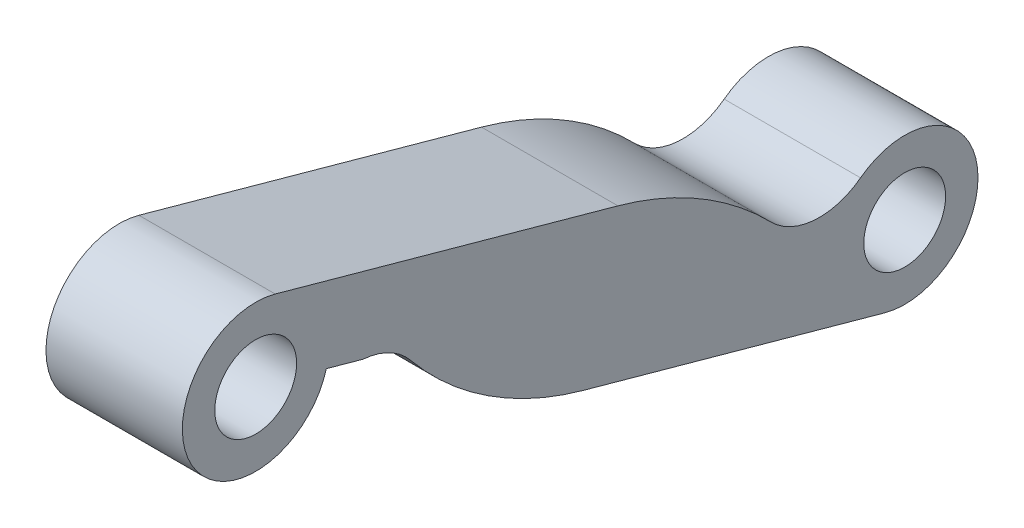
ISO-10303-21;
HEADER;
FILE_DESCRIPTION(('STEP AP214'),'2;1');
FILE_NAME('part.step','',(''),(''),'','','');
FILE_SCHEMA(('AUTOMOTIVE_DESIGN { 1 0 10303 214 1 1 1 1 }'));
ENDSEC;
DATA;
#1=APPLICATION_CONTEXT('core data for automotive mechanical design processes');
#2=APPLICATION_PROTOCOL_DEFINITION('international standard','automotive_design',2000,#1);
#3=PRODUCT_CONTEXT('',#1,'mechanical');
#4=PRODUCT('Part','Part','',(#3));
#5=PRODUCT_RELATED_PRODUCT_CATEGORY('part','',(#4));
#6=PRODUCT_DEFINITION_FORMATION('','',#4);
#7=PRODUCT_DEFINITION_CONTEXT('part definition',#1,'design');
#8=PRODUCT_DEFINITION('design','',#6,#7);
#9=PRODUCT_DEFINITION_SHAPE('','',#8);
#10=(LENGTH_UNIT() NAMED_UNIT(*) SI_UNIT(.MILLI.,.METRE.));
#11=(NAMED_UNIT(*) PLANE_ANGLE_UNIT() SI_UNIT($,.RADIAN.));
#12=(NAMED_UNIT(*) SI_UNIT($,.STERADIAN.) SOLID_ANGLE_UNIT());
#13=UNCERTAINTY_MEASURE_WITH_UNIT(LENGTH_MEASURE(1.E-05),#10,'distance_accuracy_value','');
#14=(GEOMETRIC_REPRESENTATION_CONTEXT(3) GLOBAL_UNCERTAINTY_ASSIGNED_CONTEXT((#13)) GLOBAL_UNIT_ASSIGNED_CONTEXT((#10,
#11,#12)) REPRESENTATION_CONTEXT('',''));
#15=CARTESIAN_POINT('',(0.,0.,0.));
#16=DIRECTION('',(0.,0.,1.));
#17=DIRECTION('',(1.,0.,0.));
#18=AXIS2_PLACEMENT_3D('',#15,#16,#17);
#19=CARTESIAN_POINT('',(-2.,7.00688461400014,-1.94221830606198));
#20=DIRECTION('',(0.,-0.963664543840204,0.267115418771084));
#21=DIRECTION('',(0.,-0.267115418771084,-0.963664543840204));
#22=AXIS2_PLACEMENT_3D('',#19,#20,#21);
#23=PLANE('',#22);
#24=DIRECTION('',(0.,-0.267115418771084,-0.963664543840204));
#25=VECTOR('',#24,1.);
#26=CARTESIAN_POINT('',(2.,7.00688461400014,-1.94221830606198));
#27=LINE('',#26,#25);
#28=CARTESIAN_POINT('',(2.,-2.89403745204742,-37.6614874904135));
#29=VERTEX_POINT('',#28);
#30=CARTESIAN_POINT('',(2.,-5.34848694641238,-46.5163336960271));
#31=VERTEX_POINT('',#30);
#32=EDGE_CURVE('E108',#29,#31,#27,.T.);
#33=ORIENTED_EDGE('',*,*,#32,.F.);
#34=DIRECTION('',(-1.,0.,0.));
#35=VECTOR('',#34,1.);
#36=CARTESIAN_POINT('',(-2.,-2.89403745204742,-37.6614874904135));
#37=LINE('',#36,#35);
#38=CARTESIAN_POINT('',(-2.,-2.89403745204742,-37.6614874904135));
#39=VERTEX_POINT('',#38);
#40=EDGE_CURVE('E11',#29,#39,#37,.T.);
#41=ORIENTED_EDGE('',*,*,#40,.T.);
#42=DIRECTION('',(0.,-0.267115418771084,-0.963664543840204));
#43=VECTOR('',#42,1.);
#44=CARTESIAN_POINT('',(-2.,7.00688461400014,-1.94221830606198));
#45=LINE('',#44,#43);
#46=CARTESIAN_POINT('',(-2.,-5.34848694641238,-46.5163336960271));
#47=VERTEX_POINT('',#46);
#48=EDGE_CURVE('E120',#39,#47,#45,.T.);
#49=ORIENTED_EDGE('',*,*,#48,.T.);
#50=DIRECTION('',(1.,0.,0.));
#51=VECTOR('',#50,1.);
#52=CARTESIAN_POINT('',(-2.,-5.34848694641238,-46.5163336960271));
#53=LINE('',#52,#51);
#54=EDGE_CURVE('E119',#47,#31,#53,.T.);
#55=ORIENTED_EDGE('',*,*,#54,.T.);
#56=EDGE_LOOP('',(#33,#41,#49,#55));
#57=FACE_BOUND('',#56,.T.);
#58=ADVANCED_FACE('F39',(#57),#23,.T.);
#59=CARTESIAN_POINT('',(-2.,-0.867490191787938,-31.0543656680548));
#60=DIRECTION('',(1.,0.,0.));
#61=DIRECTION('',(0.,0.,-1.));
#62=AXIS2_PLACEMENT_3D('',#59,#60,#61);
#63=CYLINDRICAL_SURFACE('',#62,2.00000000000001);
#64=CARTESIAN_POINT('',(-2.,-0.867490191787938,-31.0543656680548));
#65=DIRECTION('',(1.,0.,0.));
#66=DIRECTION('',(0.,0.,-1.));
#67=AXIS2_PLACEMENT_3D('',#64,#65,#66);
#68=CIRCLE('',#67,2.00000000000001);
#69=CARTESIAN_POINT('',(-2.,0.40085950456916,-32.6007450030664));
#70=VERTEX_POINT('',#69);
#71=CARTESIAN_POINT('',(-2.,1.12688296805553,-31.2042846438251));
#72=VERTEX_POINT('',#71);
#73=EDGE_CURVE('E164',#70,#72,#68,.T.);
#74=ORIENTED_EDGE('',*,*,#73,.F.);
#75=DIRECTION('',(1.,0.,0.));
#76=VECTOR('',#75,1.);
#77=CARTESIAN_POINT('',(-2.,0.400859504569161,-32.6007450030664));
#78=LINE('',#77,#76);
#79=CARTESIAN_POINT('',(2.,0.40085950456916,-32.6007450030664));
#80=VERTEX_POINT('',#79);
#81=EDGE_CURVE('E47',#70,#80,#78,.T.);
#82=ORIENTED_EDGE('',*,*,#81,.T.);
#83=CARTESIAN_POINT('',(2.,-0.867490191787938,-31.0543656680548));
#84=DIRECTION('',(1.,0.,0.));
#85=DIRECTION('',(0.,0.,-1.));
#86=AXIS2_PLACEMENT_3D('',#83,#84,#85);
#87=CIRCLE('',#86,2.00000000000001);
#88=CARTESIAN_POINT('',(2.,1.12688296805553,-31.2042846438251));
#89=VERTEX_POINT('',#88);
#90=EDGE_CURVE('E143',#80,#89,#87,.T.);
#91=ORIENTED_EDGE('',*,*,#90,.T.);
#92=DIRECTION('',(1.,0.,0.));
#93=VECTOR('',#92,1.);
#94=CARTESIAN_POINT('',(-2.,1.12688296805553,-31.2042846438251));
#95=LINE('',#94,#93);
#96=EDGE_CURVE('E171',#72,#89,#95,.T.);
#97=ORIENTED_EDGE('',*,*,#96,.F.);
#98=EDGE_LOOP('',(#74,#82,#91,#97));
#99=FACE_BOUND('',#98,.T.);
#100=ADVANCED_FACE('F192',(#99),#63,.F.);
#101=CARTESIAN_POINT('',(-2.,9.07876338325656,-2.5165164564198));
#102=DIRECTION('',(0.,0.963664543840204,-0.267115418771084));
#103=DIRECTION('',(0.,0.267115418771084,0.963664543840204));
#104=AXIS2_PLACEMENT_3D('',#101,#102,#103);
#105=PLANE('',#104);
#106=ORIENTED_EDGE('',*,*,#96,.T.);
#107=DIRECTION('',(0.,0.267115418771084,0.963664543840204));
#108=VECTOR('',#107,1.);
#109=CARTESIAN_POINT('',(2.,9.07876338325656,-2.5165164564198));
#110=LINE('',#109,#108);
#111=CARTESIAN_POINT('',(2.,1.42570184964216,-30.1262444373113));
#112=VERTEX_POINT('',#111);
#113=EDGE_CURVE('E140',#89,#112,#110,.T.);
#114=ORIENTED_EDGE('',*,*,#113,.T.);
#115=DIRECTION('',(1.,0.,0.));
#116=VECTOR('',#115,1.);
#117=CARTESIAN_POINT('',(-2.,1.42570184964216,-30.1262444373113));
#118=LINE('',#117,#116);
#119=CARTESIAN_POINT('',(-2.,1.42570184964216,-30.1262444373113));
#120=VERTEX_POINT('',#119);
#121=EDGE_CURVE('E175',#120,#112,#118,.T.);
#122=ORIENTED_EDGE('',*,*,#121,.F.);
#123=DIRECTION('',(0.,0.267115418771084,0.963664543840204));
#124=VECTOR('',#123,1.);
#125=CARTESIAN_POINT('',(-2.,9.07876338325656,-2.5165164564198));
#126=LINE('',#125,#124);
#127=EDGE_CURVE('E162',#72,#120,#126,.T.);
#128=ORIENTED_EDGE('',*,*,#127,.F.);
#129=EDGE_LOOP('',(#106,#114,#122,#128));
#130=FACE_BOUND('',#129,.T.);
#131=ADVANCED_FACE('F200',(#130),#105,.F.);
#132=CARTESIAN_POINT('',(-2.,2.,-28.0543656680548));
#133=DIRECTION('',(1.,0.,0.));
#134=DIRECTION('',(0.,0.,-1.));
#135=AXIS2_PLACEMENT_3D('',#132,#133,#134);
#136=CYLINDRICAL_SURFACE('',#135,2.15);
#137=ORIENTED_EDGE('',*,*,#121,.T.);
#138=CARTESIAN_POINT('',(2.,2.,-28.0543656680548));
#139=DIRECTION('',(1.,0.,0.));
#140=DIRECTION('',(0.,0.,-1.));
#141=AXIS2_PLACEMENT_3D('',#138,#139,#140);
#142=CIRCLE('',#141,2.15);
#143=CARTESIAN_POINT('',(2.,4.07187876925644,-28.6286638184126));
#144=VERTEX_POINT('',#143);
#145=EDGE_CURVE('E137',#144,#112,#142,.T.);
#146=ORIENTED_EDGE('',*,*,#145,.F.);
#147=DIRECTION('',(1.,0.,0.));
#148=VECTOR('',#147,1.);
#149=CARTESIAN_POINT('',(-2.,4.07187876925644,-28.6286638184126));
#150=LINE('',#149,#148);
#151=CARTESIAN_POINT('',(-2.,4.07187876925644,-28.6286638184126));
#152=VERTEX_POINT('',#151);
#153=EDGE_CURVE('E177',#152,#144,#150,.T.);
#154=ORIENTED_EDGE('',*,*,#153,.F.);
#155=CARTESIAN_POINT('',(-2.,2.,-28.0543656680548));
#156=DIRECTION('',(1.,0.,0.));
#157=DIRECTION('',(0.,0.,-1.));
#158=AXIS2_PLACEMENT_3D('',#155,#156,#157);
#159=CIRCLE('',#158,2.15);
#160=EDGE_CURVE('E159',#152,#120,#159,.T.);
#161=ORIENTED_EDGE('',*,*,#160,.T.);
#162=EDGE_LOOP('',(#137,#146,#154,#161));
#163=FACE_BOUND('',#162,.T.);
#164=ADVANCED_FACE('F208',(#163),#136,.T.);
#165=CARTESIAN_POINT('',(-2.,11.150642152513,-3.09081460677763));
#166=DIRECTION('',(0.,-0.963664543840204,0.267115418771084));
#167=DIRECTION('',(0.,-0.267115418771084,-0.963664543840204));
#168=AXIS2_PLACEMENT_3D('',#165,#166,#167);
#169=PLANE('',#168);
#170=DIRECTION('',(0.,-0.267115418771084,-0.963664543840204));
#171=VECTOR('',#170,1.);
#172=CARTESIAN_POINT('',(2.,11.150642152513,-3.09081460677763));
#173=LINE('',#172,#171);
#174=CARTESIAN_POINT('',(2.,1.28612329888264,-38.6787529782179));
#175=VERTEX_POINT('',#174);
#176=EDGE_CURVE('E132',#144,#175,#173,.T.);
#177=ORIENTED_EDGE('',*,*,#176,.T.);
#178=DIRECTION('',(1.,0.,0.));
#179=VECTOR('',#178,1.);
#180=CARTESIAN_POINT('',(-2.,1.28612329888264,-38.6787529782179));
#181=LINE('',#180,#179);
#182=CARTESIAN_POINT('',(-2.,1.28612329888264,-38.6787529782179));
#183=VERTEX_POINT('',#182);
#184=EDGE_CURVE('E185',#175,#183,#181,.F.);
#185=ORIENTED_EDGE('',*,*,#184,.T.);
#186=DIRECTION('',(0.,-0.267115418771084,-0.963664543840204));
#187=VECTOR('',#186,1.);
#188=CARTESIAN_POINT('',(-2.,11.150642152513,-3.09081460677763));
#189=LINE('',#188,#187);
#190=EDGE_CURVE('E156',#152,#183,#189,.T.);
#191=ORIENTED_EDGE('',*,*,#190,.F.);
#192=ORIENTED_EDGE('',*,*,#153,.T.);
#193=EDGE_LOOP('',(#177,#185,#191,#192));
#194=FACE_BOUND('',#193,.T.);
#195=ADVANCED_FACE('F210',(#194),#169,.F.);
#196=CARTESIAN_POINT('',(-2.,0.0358682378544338,-44.5906318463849));
#197=DIRECTION('',(1.,0.,0.));
#198=DIRECTION('',(0.,0.,-1.));
#199=AXIS2_PLACEMENT_3D('',#196,#197,#198);
#200=CYLINDRICAL_SURFACE('',#199,2.);
#201=CARTESIAN_POINT('',(-2.,0.0358682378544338,-44.5906318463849));
#202=DIRECTION('',(1.,0.,0.));
#203=DIRECTION('',(0.,0.,-1.));
#204=AXIS2_PLACEMENT_3D('',#201,#202,#203);
#205=CIRCLE('',#204,2.);
#206=CARTESIAN_POINT('',(-2.,-1.36186349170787,-43.160126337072));
#207=VERTEX_POINT('',#206);
#208=CARTESIAN_POINT('',(-2.,-1.56050593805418,-45.7954511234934));
#209=VERTEX_POINT('',#208);
#210=EDGE_CURVE('E154',#207,#209,#205,.T.);
#211=ORIENTED_EDGE('',*,*,#210,.F.);
#212=DIRECTION('',(1.,0.,0.));
#213=VECTOR('',#212,1.);
#214=CARTESIAN_POINT('',(-2.,-1.36186349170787,-43.160126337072));
#215=LINE('',#214,#213);
#216=CARTESIAN_POINT('',(2.,-1.36186349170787,-43.160126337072));
#217=VERTEX_POINT('',#216);
#218=EDGE_CURVE('E174',#207,#217,#215,.T.);
#219=ORIENTED_EDGE('',*,*,#218,.T.);
#220=CARTESIAN_POINT('',(2.,0.0358682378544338,-44.5906318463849));
#221=DIRECTION('',(1.,0.,0.));
#222=DIRECTION('',(0.,0.,-1.));
#223=AXIS2_PLACEMENT_3D('',#220,#221,#222);
#224=CIRCLE('',#223,2.);
#225=CARTESIAN_POINT('',(2.,-1.56050593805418,-45.7954511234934));
#226=VERTEX_POINT('',#225);
#227=EDGE_CURVE('E130',#217,#226,#224,.T.);
#228=ORIENTED_EDGE('',*,*,#227,.T.);
#229=DIRECTION('',(1.,0.,0.));
#230=VECTOR('',#229,1.);
#231=CARTESIAN_POINT('',(-2.,-1.56050593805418,-45.7954511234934));
#232=LINE('',#231,#230);
#233=EDGE_CURVE('E124',#209,#226,#232,.T.);
#234=ORIENTED_EDGE('',*,*,#233,.F.);
#235=EDGE_LOOP('',(#211,#219,#228,#234));
#236=FACE_BOUND('',#235,.T.);
#237=ADVANCED_FACE('F217',(#236),#200,.F.);
#238=CARTESIAN_POINT('',(-2.,2.,-28.0543656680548));
#239=DIRECTION('',(1.,0.,0.));
#240=DIRECTION('',(0.,0.,-1.));
#241=AXIS2_PLACEMENT_3D('',#238,#239,#240);
#242=CYLINDRICAL_SURFACE('',#241,1.2);
#243=CARTESIAN_POINT('',(-2.,2.,-28.0543656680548));
#244=DIRECTION('',(1.,0.,0.));
#245=DIRECTION('',(0.,0.,-1.));
#246=AXIS2_PLACEMENT_3D('',#243,#244,#245);
#247=CIRCLE('',#246,1.2);
#248=CARTESIAN_POINT('',(-2.,2.,-29.2543656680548));
#249=VERTEX_POINT('',#248);
#250=EDGE_CURVE('E166',#249,#249,#247,.T.);
#251=ORIENTED_EDGE('',*,*,#250,.F.);
#252=EDGE_LOOP('',(#251));
#253=FACE_BOUND('',#252,.T.);
#254=CARTESIAN_POINT('',(2.,2.,-28.0543656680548));
#255=DIRECTION('',(1.,0.,0.));
#256=DIRECTION('',(0.,0.,-1.));
#257=AXIS2_PLACEMENT_3D('',#254,#255,#256);
#258=CIRCLE('',#257,1.2);
#259=CARTESIAN_POINT('',(2.,2.,-29.2543656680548));
#260=VERTEX_POINT('',#259);
#261=EDGE_CURVE('E145',#260,#260,#258,.T.);
#262=ORIENTED_EDGE('',*,*,#261,.T.);
#263=EDGE_LOOP('',(#262));
#264=FACE_BOUND('',#263,.T.);
#265=ADVANCED_FACE('F232',(#253,#264),#242,.F.);
#266=CARTESIAN_POINT('',(-2.,-3.27660817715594,-47.0906318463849));
#267=DIRECTION('',(1.,0.,0.));
#268=DIRECTION('',(0.,0.,-1.));
#269=AXIS2_PLACEMENT_3D('',#266,#267,#268);
#270=CYLINDRICAL_SURFACE('',#269,2.15);
#271=ORIENTED_EDGE('',*,*,#233,.T.);
#272=CARTESIAN_POINT('',(2.,-3.27660817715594,-47.0906318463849));
#273=DIRECTION('',(1.,0.,0.));
#274=DIRECTION('',(0.,0.,-1.));
#275=AXIS2_PLACEMENT_3D('',#272,#273,#274);
#276=CIRCLE('',#275,2.15);
#277=EDGE_CURVE('E114',#31,#226,#276,.T.);
#278=ORIENTED_EDGE('',*,*,#277,.F.);
#279=ORIENTED_EDGE('',*,*,#54,.F.);
#280=CARTESIAN_POINT('',(-2.,-3.27660817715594,-47.0906318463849));
#281=DIRECTION('',(1.,0.,0.));
#282=DIRECTION('',(0.,0.,-1.));
#283=AXIS2_PLACEMENT_3D('',#280,#281,#282);
#284=CIRCLE('',#283,2.15);
#285=EDGE_CURVE('E152',#47,#209,#284,.T.);
#286=ORIENTED_EDGE('',*,*,#285,.T.);
#287=EDGE_LOOP('',(#271,#278,#279,#286));
#288=FACE_BOUND('',#287,.T.);
#289=ADVANCED_FACE('F128',(#288),#270,.T.);
#290=CARTESIAN_POINT('',(-2.,-3.27660817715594,-47.0906318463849));
#291=DIRECTION('',(1.,0.,0.));
#292=DIRECTION('',(0.,0.,-1.));
#293=AXIS2_PLACEMENT_3D('',#290,#291,#292);
#294=CYLINDRICAL_SURFACE('',#293,1.19999999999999);
#295=CARTESIAN_POINT('',(-2.,-3.27660817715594,-47.0906318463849));
#296=DIRECTION('',(1.,0.,0.));
#297=DIRECTION('',(0.,0.,-1.));
#298=AXIS2_PLACEMENT_3D('',#295,#296,#297);
#299=CIRCLE('',#298,1.19999999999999);
#300=CARTESIAN_POINT('',(-2.,-3.27660817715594,-48.2906318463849));
#301=VERTEX_POINT('',#300);
#302=EDGE_CURVE('E125',#301,#301,#299,.T.);
#303=ORIENTED_EDGE('',*,*,#302,.F.);
#304=EDGE_LOOP('',(#303));
#305=FACE_BOUND('',#304,.T.);
#306=CARTESIAN_POINT('',(2.,-3.27660817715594,-47.0906318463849));
#307=DIRECTION('',(1.,0.,0.));
#308=DIRECTION('',(0.,0.,-1.));
#309=AXIS2_PLACEMENT_3D('',#306,#307,#308);
#310=CIRCLE('',#309,1.19999999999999);
#311=CARTESIAN_POINT('',(2.,-3.27660817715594,-48.2906318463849));
#312=VERTEX_POINT('',#311);
#313=EDGE_CURVE('E148',#312,#312,#310,.T.);
#314=ORIENTED_EDGE('',*,*,#313,.T.);
#315=EDGE_LOOP('',(#314));
#316=FACE_BOUND('',#315,.T.);
#317=ADVANCED_FACE('F231',(#305,#316),#294,.F.);
#318=CARTESIAN_POINT('',(-2.,0.,0.));
#319=DIRECTION('',(1.,0.,0.));
#320=DIRECTION('',(0.,0.,-1.));
#321=AXIS2_PLACEMENT_3D('',#318,#319,#320);
#322=PLANE('',#321);
#323=ORIENTED_EDGE('',*,*,#190,.T.);
#324=CARTESIAN_POINT('',(-2.,-8.3505221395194,-36.0075987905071));
#325=DIRECTION('',(1.,0.,0.));
#326=DIRECTION('',(0.,0.,-1.));
#327=AXIS2_PLACEMENT_3D('',#324,#325,#326);
#328=CIRCLE('',#327,10.);
#329=EDGE_CURVE('E188',#183,#207,#328,.F.);
#330=ORIENTED_EDGE('',*,*,#329,.T.);
#331=ORIENTED_EDGE('',*,*,#210,.T.);
#332=ORIENTED_EDGE('',*,*,#285,.F.);
#333=ORIENTED_EDGE('',*,*,#48,.F.);
#334=CARTESIAN_POINT('',(-2.,6.74260798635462,-40.3326416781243));
#335=DIRECTION('',(1.,0.,0.));
#336=DIRECTION('',(0.,0.,-1.));
#337=AXIS2_PLACEMENT_3D('',#334,#335,#336);
#338=CIRCLE('',#337,10.);
#339=EDGE_CURVE('E54',#39,#70,#338,.F.);
#340=ORIENTED_EDGE('',*,*,#339,.T.);
#341=ORIENTED_EDGE('',*,*,#73,.T.);
#342=ORIENTED_EDGE('',*,*,#127,.T.);
#343=ORIENTED_EDGE('',*,*,#160,.F.);
#344=EDGE_LOOP('',(#323,#330,#331,#332,#333,#340,#341,#342,#343));
#345=FACE_BOUND('',#344,.T.);
#346=ORIENTED_EDGE('',*,*,#250,.T.);
#347=EDGE_LOOP('',(#346));
#348=FACE_BOUND('',#347,.T.);
#349=ORIENTED_EDGE('',*,*,#302,.T.);
#350=EDGE_LOOP('',(#349));
#351=FACE_BOUND('',#350,.T.);
#352=ADVANCED_FACE('F203',(#345,#348,#351),#322,.F.);
#353=CARTESIAN_POINT('',(2.,0.,0.));
#354=DIRECTION('',(1.,0.,0.));
#355=DIRECTION('',(0.,0.,-1.));
#356=AXIS2_PLACEMENT_3D('',#353,#354,#355);
#357=PLANE('',#356);
#358=ORIENTED_EDGE('',*,*,#227,.F.);
#359=CARTESIAN_POINT('',(2.,-8.3505221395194,-36.0075987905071));
#360=DIRECTION('',(1.,0.,0.));
#361=DIRECTION('',(0.,0.,-1.));
#362=AXIS2_PLACEMENT_3D('',#359,#360,#361);
#363=CIRCLE('',#362,10.);
#364=EDGE_CURVE('E183',#217,#175,#363,.T.);
#365=ORIENTED_EDGE('',*,*,#364,.T.);
#366=ORIENTED_EDGE('',*,*,#176,.F.);
#367=ORIENTED_EDGE('',*,*,#145,.T.);
#368=ORIENTED_EDGE('',*,*,#113,.F.);
#369=ORIENTED_EDGE('',*,*,#90,.F.);
#370=CARTESIAN_POINT('',(2.,6.74260798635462,-40.3326416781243));
#371=DIRECTION('',(1.,0.,0.));
#372=DIRECTION('',(0.,0.,-1.));
#373=AXIS2_PLACEMENT_3D('',#370,#371,#372);
#374=CIRCLE('',#373,10.);
#375=EDGE_CURVE('E116',#80,#29,#374,.T.);
#376=ORIENTED_EDGE('',*,*,#375,.T.);
#377=ORIENTED_EDGE('',*,*,#32,.T.);
#378=ORIENTED_EDGE('',*,*,#277,.T.);
#379=EDGE_LOOP('',(#358,#365,#366,#367,#368,#369,#376,#377,#378));
#380=FACE_BOUND('',#379,.T.);
#381=ORIENTED_EDGE('',*,*,#261,.F.);
#382=EDGE_LOOP('',(#381));
#383=FACE_BOUND('',#382,.T.);
#384=ORIENTED_EDGE('',*,*,#313,.F.);
#385=EDGE_LOOP('',(#384));
#386=FACE_BOUND('',#385,.T.);
#387=ADVANCED_FACE('F111',(#380,#383,#386),#357,.T.);
#388=CARTESIAN_POINT('',(-2.,-8.3505221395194,-36.0075987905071));
#389=DIRECTION('',(1.,0.,0.));
#390=DIRECTION('',(0.,0.,-1.));
#391=AXIS2_PLACEMENT_3D('',#388,#389,#390);
#392=CYLINDRICAL_SURFACE('',#391,10.);
#393=ORIENTED_EDGE('',*,*,#329,.F.);
#394=ORIENTED_EDGE('',*,*,#184,.F.);
#395=ORIENTED_EDGE('',*,*,#364,.F.);
#396=ORIENTED_EDGE('',*,*,#218,.F.);
#397=EDGE_LOOP('',(#393,#394,#395,#396));
#398=FACE_BOUND('',#397,.T.);
#399=ADVANCED_FACE('F213',(#398),#392,.T.);
#400=CARTESIAN_POINT('',(-2.,6.74260798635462,-40.3326416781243));
#401=DIRECTION('',(1.,0.,0.));
#402=DIRECTION('',(0.,0.,-1.));
#403=AXIS2_PLACEMENT_3D('',#400,#401,#402);
#404=CYLINDRICAL_SURFACE('',#403,10.);
#405=ORIENTED_EDGE('',*,*,#339,.F.);
#406=ORIENTED_EDGE('',*,*,#40,.F.);
#407=ORIENTED_EDGE('',*,*,#375,.F.);
#408=ORIENTED_EDGE('',*,*,#81,.F.);
#409=EDGE_LOOP('',(#405,#406,#407,#408));
#410=FACE_BOUND('',#409,.T.);
#411=ADVANCED_FACE('F41',(#410),#404,.T.);
#412=CLOSED_SHELL('',(#58,#100,#131,#164,#195,#237,#265,#289,#317,#352,#387,#399,#411));
#413=MANIFOLD_SOLID_BREP('B2',#412);
#414=ADVANCED_BREP_SHAPE_REPRESENTATION('',(#18,#413),#14);
#415=SHAPE_DEFINITION_REPRESENTATION(#9,#414);
ENDSEC;
END-ISO-10303-21;
